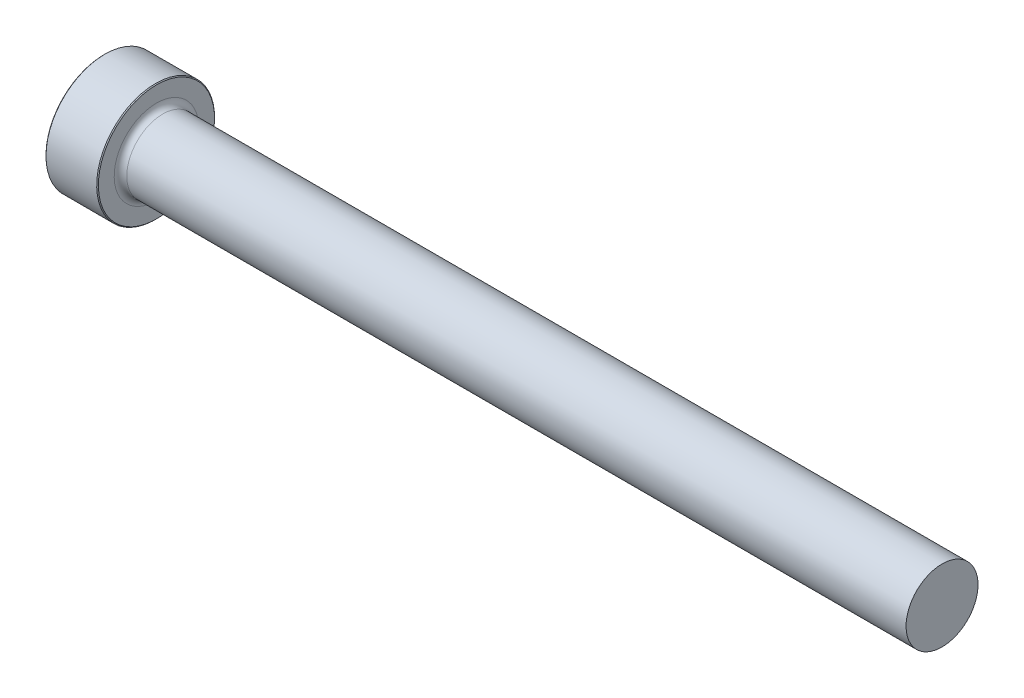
ISO-10303-21;
HEADER;
FILE_DESCRIPTION(('STEP AP214'),'2;1');
FILE_NAME('part.step','',(''),(''),'','','');
FILE_SCHEMA(('AUTOMOTIVE_DESIGN { 1 0 10303 214 1 1 1 1 }'));
ENDSEC;
DATA;
#1=APPLICATION_CONTEXT('core data for automotive mechanical design processes');
#2=APPLICATION_PROTOCOL_DEFINITION('international standard','automotive_design',2000,#1);
#3=PRODUCT_CONTEXT('',#1,'mechanical');
#4=PRODUCT('Part','Part','',(#3));
#5=PRODUCT_RELATED_PRODUCT_CATEGORY('part','',(#4));
#6=PRODUCT_DEFINITION_FORMATION('','',#4);
#7=PRODUCT_DEFINITION_CONTEXT('part definition',#1,'design');
#8=PRODUCT_DEFINITION('design','',#6,#7);
#9=PRODUCT_DEFINITION_SHAPE('','',#8);
#10=(LENGTH_UNIT() NAMED_UNIT(*) SI_UNIT(.MILLI.,.METRE.));
#11=(NAMED_UNIT(*) PLANE_ANGLE_UNIT() SI_UNIT($,.RADIAN.));
#12=(NAMED_UNIT(*) SI_UNIT($,.STERADIAN.) SOLID_ANGLE_UNIT());
#13=UNCERTAINTY_MEASURE_WITH_UNIT(LENGTH_MEASURE(1.E-05),#10,'distance_accuracy_value','');
#14=(GEOMETRIC_REPRESENTATION_CONTEXT(3) GLOBAL_UNCERTAINTY_ASSIGNED_CONTEXT((#13)) GLOBAL_UNIT_ASSIGNED_CONTEXT((#10,
#11,#12)) REPRESENTATION_CONTEXT('',''));
#15=CARTESIAN_POINT('',(0.,0.,0.));
#16=DIRECTION('',(0.,0.,1.));
#17=DIRECTION('',(1.,0.,0.));
#18=AXIS2_PLACEMENT_3D('',#15,#16,#17);
#19=CARTESIAN_POINT('',(101.6,4.36181499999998,0.));
#20=DIRECTION('',(1.,0.,0.));
#21=DIRECTION('',(0.,1.,0.));
#22=AXIS2_PLACEMENT_3D('',#19,#20,#21);
#23=PLANE('',#22);
#24=CARTESIAN_POINT('',(101.6,0.,0.));
#25=DIRECTION('',(1.,0.,0.));
#26=DIRECTION('',(0.,1.,0.));
#27=AXIS2_PLACEMENT_3D('',#24,#25,#26);
#28=CIRCLE('',#27,4.36181499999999);
#29=CARTESIAN_POINT('',(101.6,4.36181499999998,0.));
#30=VERTEX_POINT('',#29);
#31=EDGE_CURVE('E50',#30,#30,#28,.T.);
#32=ORIENTED_EDGE('',*,*,#31,.T.);
#33=EDGE_LOOP('',(#32));
#34=FACE_BOUND('',#33,.T.);
#35=ADVANCED_FACE('F30',(#34),#23,.T.);
#36=CARTESIAN_POINT('',(101.6,0.,0.));
#37=DIRECTION('',(1.,0.,0.));
#38=DIRECTION('',(0.,1.,0.));
#39=AXIS2_PLACEMENT_3D('',#36,#37,#38);
#40=CYLINDRICAL_SURFACE('',#39,4.36181499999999);
#41=CARTESIAN_POINT('',(7.11199999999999,0.,0.));
#42=DIRECTION('',(1.,0.,0.));
#43=DIRECTION('',(0.,1.,0.));
#44=AXIS2_PLACEMENT_3D('',#41,#42,#43);
#45=CIRCLE('',#44,4.36181499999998);
#46=CARTESIAN_POINT('',(7.11199999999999,4.36181499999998,0.));
#47=VERTEX_POINT('',#46);
#48=EDGE_CURVE('E53',#47,#47,#45,.T.);
#49=ORIENTED_EDGE('',*,*,#48,.T.);
#50=EDGE_LOOP('',(#49));
#51=FACE_BOUND('',#50,.T.);
#52=ORIENTED_EDGE('',*,*,#31,.F.);
#53=EDGE_LOOP('',(#52));
#54=FACE_BOUND('',#53,.T.);
#55=ADVANCED_FACE('F74',(#51,#54),#40,.T.);
#56=CARTESIAN_POINT('',(7.112,0.,0.));
#57=DIRECTION('',(1.,0.,0.));
#58=DIRECTION('',(0.,1.,0.));
#59=AXIS2_PLACEMENT_3D('',#56,#57,#58);
#60=TOROIDAL_SURFACE('',#59,5.12381499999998,0.761999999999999);
#61=CARTESIAN_POINT('',(6.34999999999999,0.,0.));
#62=DIRECTION('',(1.,0.,0.));
#63=DIRECTION('',(0.,1.,0.));
#64=AXIS2_PLACEMENT_3D('',#61,#62,#63);
#65=CIRCLE('',#64,5.12381499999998);
#66=CARTESIAN_POINT('',(6.34999999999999,5.12381499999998,0.));
#67=VERTEX_POINT('',#66);
#68=EDGE_CURVE('E56',#67,#67,#65,.T.);
#69=ORIENTED_EDGE('',*,*,#68,.T.);
#70=EDGE_LOOP('',(#69));
#71=FACE_BOUND('',#70,.T.);
#72=ORIENTED_EDGE('',*,*,#48,.F.);
#73=EDGE_LOOP('',(#72));
#74=FACE_BOUND('',#73,.T.);
#75=ADVANCED_FACE('F60',(#71,#74),#60,.F.);
#76=CARTESIAN_POINT('',(6.35,7.14375,0.));
#77=DIRECTION('',(1.,0.,0.));
#78=DIRECTION('',(0.,1.,0.));
#79=AXIS2_PLACEMENT_3D('',#76,#77,#78);
#80=PLANE('',#79);
#81=CARTESIAN_POINT('',(6.35,0.,0.));
#82=DIRECTION('',(1.,0.,0.));
#83=DIRECTION('',(0.,1.,0.));
#84=AXIS2_PLACEMENT_3D('',#81,#82,#83);
#85=CIRCLE('',#84,7.04215000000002);
#86=CARTESIAN_POINT('',(6.35,7.04215000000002,0.));
#87=VERTEX_POINT('',#86);
#88=EDGE_CURVE('E10',#87,#87,#85,.T.);
#89=ORIENTED_EDGE('',*,*,#88,.T.);
#90=EDGE_LOOP('',(#89));
#91=FACE_BOUND('',#90,.T.);
#92=ORIENTED_EDGE('',*,*,#68,.F.);
#93=EDGE_LOOP('',(#92));
#94=FACE_BOUND('',#93,.T.);
#95=ADVANCED_FACE('F63',(#91,#94),#80,.T.);
#96=CARTESIAN_POINT('',(101.6,0.,0.));
#97=DIRECTION('',(1.,0.,0.));
#98=DIRECTION('',(0.,1.,0.));
#99=AXIS2_PLACEMENT_3D('',#96,#97,#98);
#100=CYLINDRICAL_SURFACE('',#99,7.14375);
#101=CARTESIAN_POINT('',(0.101600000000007,0.,0.));
#102=DIRECTION('',(-1.,0.,0.));
#103=DIRECTION('',(0.,-1.,0.));
#104=AXIS2_PLACEMENT_3D('',#101,#102,#103);
#105=CIRCLE('',#104,7.14375);
#106=CARTESIAN_POINT('',(0.101600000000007,-7.14375,0.));
#107=VERTEX_POINT('',#106);
#108=EDGE_CURVE('E41',#107,#107,#105,.F.);
#109=ORIENTED_EDGE('',*,*,#108,.T.);
#110=EDGE_LOOP('',(#109));
#111=FACE_BOUND('',#110,.T.);
#112=CARTESIAN_POINT('',(6.24840000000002,0.,0.));
#113=DIRECTION('',(1.,0.,0.));
#114=DIRECTION('',(0.,1.,0.));
#115=AXIS2_PLACEMENT_3D('',#112,#113,#114);
#116=CIRCLE('',#115,7.14375);
#117=CARTESIAN_POINT('',(6.24840000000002,7.14375,0.));
#118=VERTEX_POINT('',#117);
#119=EDGE_CURVE('E45',#118,#118,#116,.F.);
#120=ORIENTED_EDGE('',*,*,#119,.T.);
#121=EDGE_LOOP('',(#120));
#122=FACE_BOUND('',#121,.T.);
#123=ADVANCED_FACE('F65',(#111,#122),#100,.T.);
#124=CARTESIAN_POINT('',(0.,0.,0.));
#125=DIRECTION('',(-1.,0.,0.));
#126=DIRECTION('',(0.,-1.,0.));
#127=AXIS2_PLACEMENT_3D('',#124,#125,#126);
#128=PLANE('',#127);
#129=CARTESIAN_POINT('',(0.,0.,0.));
#130=DIRECTION('',(-1.,0.,0.));
#131=DIRECTION('',(0.,-1.,0.));
#132=AXIS2_PLACEMENT_3D('',#129,#130,#131);
#133=CIRCLE('',#132,7.04215);
#134=CARTESIAN_POINT('',(0.,-7.04215,0.));
#135=VERTEX_POINT('',#134);
#136=EDGE_CURVE('E37',#135,#135,#133,.T.);
#137=ORIENTED_EDGE('',*,*,#136,.T.);
#138=EDGE_LOOP('',(#137));
#139=FACE_BOUND('',#138,.T.);
#140=ADVANCED_FACE('F71',(#139),#128,.T.);
#141=CARTESIAN_POINT('',(0.101600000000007,0.,0.));
#142=DIRECTION('',(1.,0.,0.));
#143=DIRECTION('',(0.,1.,0.));
#144=AXIS2_PLACEMENT_3D('',#141,#142,#143);
#145=CONICAL_SURFACE('',#144,7.14375,0.785398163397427);
#146=ORIENTED_EDGE('',*,*,#136,.F.);
#147=EDGE_LOOP('',(#146));
#148=FACE_BOUND('',#147,.T.);
#149=ORIENTED_EDGE('',*,*,#108,.F.);
#150=EDGE_LOOP('',(#149));
#151=FACE_BOUND('',#150,.T.);
#152=ADVANCED_FACE('F84',(#148,#151),#145,.T.);
#153=CARTESIAN_POINT('',(6.34999999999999,0.,0.));
#154=DIRECTION('',(-1.,0.,0.));
#155=DIRECTION('',(0.,-1.,0.));
#156=AXIS2_PLACEMENT_3D('',#153,#154,#155);
#157=CONICAL_SURFACE('',#156,7.04215000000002,0.785398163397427);
#158=ORIENTED_EDGE('',*,*,#119,.F.);
#159=EDGE_LOOP('',(#158));
#160=FACE_BOUND('',#159,.T.);
#161=ORIENTED_EDGE('',*,*,#88,.F.);
#162=EDGE_LOOP('',(#161));
#163=FACE_BOUND('',#162,.T.);
#164=ADVANCED_FACE('F32',(#160,#163),#157,.T.);
#165=CLOSED_SHELL('',(#35,#55,#75,#95,#123,#140,#152,#164));
#166=MANIFOLD_SOLID_BREP('B2',#165);
#167=ADVANCED_BREP_SHAPE_REPRESENTATION('',(#18,#166),#14);
#168=SHAPE_DEFINITION_REPRESENTATION(#9,#167);
ENDSEC;
END-ISO-10303-21;
